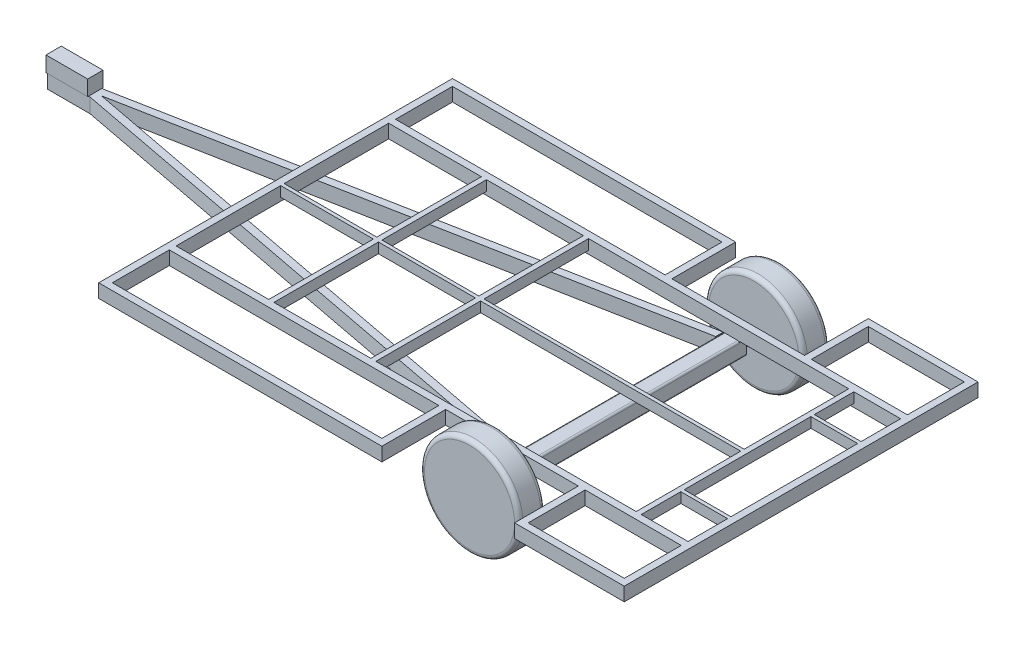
from build123d import *

# Parameters (mm, degrees)
ESQUISSE1_W              = 3090
ESQUISSE1_H              = 2080
ESQUISSE1_W_2            = 3010
ESQUISSE1_H_2            = 2000
BOSS_EXTRU_1_DEPTH       = 80
ESQUISSE2_W              = 3010
ESQUISSE2_H              = 40
ESQUISSE2_W_2            = 40
ESQUISSE2_H_2            = 335
BOSS_EXTRU_7_DEPTH       = 80
BOSS_EXTRU_8_START       = 20
BOSS_EXTRU_8_DEPTH       = 60
ESQUISSE5_W              = 780
ESQUISSE5_H              = 50
ENL_V_MAT_EXTRU_5_DEPTH  = 3726.70798641
ESQUISSE6_W              = 95
ESQUISSE6_H              = 1330
BOSS_EXTRU_9_DEPTH       = 95
CONG_1_R                 = 10
BOSS_EXTRU_10_DEPTH      = 95
BOSS_EXTRU_10_DEPTH_BACK = 1422
ESQUISSE8_R              = 35
ESQUISSE9_R              = 290
BOSS_EXTRU_11_DEPTH      = 155
BOSS_EXTRU_12_START      = 155
ESQUISSE10_R             = 290
BOSS_EXTRU_12_DEPTH      = 155
CONG_2_R                 = 25
BOSS_EXTRU_26_DEPTH      = 85
ESQUISSE12_W             = 245
ESQUISSE12_H             = 90
BOSS_EXTRU_27_DEPTH      = 90


with BuildPart() as part:
    # Esquisse1 → Boss.-Extru.1 (new body)
    with BuildSketch(Plane(origin=(0, 0, 0), x_dir=(1, 0, 0), z_dir=(0, 1, 0))):
        with Locations((1545, 1040)):
            Rectangle(ESQUISSE1_W, ESQUISSE1_H)
        with Locations((1545, 1040)):
            Rectangle(ESQUISSE1_W_2, ESQUISSE1_H_2, mode=Mode.SUBTRACT)
    extrude(amount=BOSS_EXTRU_1_DEPTH)

    # Esquisse2 → Boss.-Extru.7 (add)
    with BuildSketch(Plane(origin=(0, 0, 0), x_dir=(1, 0, 0), z_dir=(0, 1, 0))):
        with Locations((1545, 1685)):
            Rectangle(ESQUISSE2_W, ESQUISSE2_H)
        with Locations((1545, 395)):
            Rectangle(ESQUISSE2_W, ESQUISSE2_H)
        with Locations((1645, 1872.5)):
            Rectangle(ESQUISSE2_W_2, ESQUISSE2_H_2)
        with Locations((2465, 1872.5)):
            Rectangle(ESQUISSE2_W_2, ESQUISSE2_H_2)
        with Locations((1645, 207.5)):
            Rectangle(ESQUISSE2_W_2, ESQUISSE2_H_2)
        with Locations((2465, 207.5)):
            Rectangle(ESQUISSE2_W_2, ESQUISSE2_H_2)
    extrude(amount=BOSS_EXTRU_7_DEPTH)

    # Esquisse4 → Boss.-Extru.8 (add)
    with BuildSketch(Plane(origin=(0, 0, 0), x_dir=(1, 0, 0), z_dir=(0, 1, 0)).offset(BOSS_EXTRU_8_START)):
        Polygon((40, 1050), (585, 1050), (585, 1665), (615, 1665), (615, 1050), (1185, 1050), (1185, 1665), (1215, 1665), (1215, 1050), (2745, 1050), (2745, 1665), (2775, 1665), (2775, 1432.5), (3050, 1432.5), (3050, 1412.5), (2775, 1412.5), (2775, 667.5), (3050, 667.5), (3050, 647.5), (2775, 647.5), (2775, 415), (2745, 415), (2745, 1030), (1215, 1030), (1215, 415), (1185, 415), (1185, 1030), (615, 1030), (615, 415), (585, 415), (585, 1030), (40, 1030), align=None)
    extrude(amount=BOSS_EXTRU_8_DEPTH)

    # Esquisse5 → Enl_v. mat.-Extru.5 (cut, through all)
    with BuildSketch(Plane(origin=(0, 0, 0), x_dir=(1, 0, 0), z_dir=(0, 1, 0))):
        with Locations((2055, 2065)):
            Rectangle(ESQUISSE5_W, ESQUISSE5_H)
        with Locations((2055, 15)):
            Rectangle(ESQUISSE5_W, ESQUISSE5_H)
    extrude(amount=ENL_V_MAT_EXTRU_5_DEPTH, mode=Mode.SUBTRACT)

    # Esquisse6 → Boss.-Extru.9 (add)
    with BuildSketch(Plane(origin=(0, 0, 0), x_dir=(1, 0, 0), z_dir=(0, 1, 0))):
        with Locations((2055, 1040)):
            Rectangle(ESQUISSE6_W, ESQUISSE6_H)
    extrude(amount=-BOSS_EXTRU_9_DEPTH)

    # Cong_1
    cong_1_edges = [part.edges().sort_by_distance(p)[0] for p in [
        (2007.5, 0, -1040),
        (2102.5, 0, -1040),
        (2007.5, -95, -1040),
        (2102.5, -95, -1040),
    ]]
    fillet(cong_1_edges, radius=CONG_1_R)

    # Esquisse8 → Boss.-Extru.10 (add, two sides: drawn at the far end of the back side and taken through both)
    with BuildSketch(Plane.XY.offset(-375).offset(-BOSS_EXTRU_10_DEPTH_BACK)):
        with Locations((2055, -47.5)):
            Circle(ESQUISSE8_R)
    extrude(amount=BOSS_EXTRU_10_DEPTH + BOSS_EXTRU_10_DEPTH_BACK)

    # Esquisse9 → Boss.-Extru.11 (add)
    with BuildSketch(Plane.XY.offset(-280)):
        with Locations((2055, -47.5)):
            Circle(ESQUISSE9_R)
    extrude(amount=BOSS_EXTRU_11_DEPTH)

    # Esquisse10 → Boss.-Extru.12 (add)
    with BuildSketch(Plane(origin=(0, 0, -1797), x_dir=(-1, 0, 0), z_dir=(0, 0, -1)).offset(BOSS_EXTRU_12_START)):
        with Locations(Location((-2055, -47.5, 0), (0, 0, 180))):
            Circle(ESQUISSE10_R)
    extrude(amount=-BOSS_EXTRU_12_DEPTH)

    # Cong_2
    cong_2_edges = [part.edges().sort_by_distance(p)[0] for p in [
        (1765, -47.5, -280),
        (1765, -47.5, -125),
        (1765, -47.5, -1797),
        (1765, -47.5, -1952),
    ]]
    fillet(cong_2_edges, radius=CONG_2_R)


with BuildPart() as body_2:
    # Esquisse11 → Boss.-Extru.26 (new body)
    with BuildSketch(Plane.XZ):
        Polygon((-1300, -1080), (-1050, -1080), (2007.5, -1665), (2007.5, -1620), (-1021.254273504, -1040.5), (-1021.254273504, -1039.5), (2007.5, -460), (2007.5, -415), (-1050, -1000), (-1300, -1000), align=None)
    extrude(amount=BOSS_EXTRU_26_DEPTH)

    # Esquisse12 → Boss.-Extru.27 (add)
    with BuildSketch(Plane(origin=(0, 0, 0), x_dir=(1, 0, 0), z_dir=(0, 1, 0))):
        with Locations((-1182.5, 1040)):
            Rectangle(ESQUISSE12_W, ESQUISSE12_H)
    extrude(amount=BOSS_EXTRU_27_DEPTH)


solid = Compound([part.part, body_2.part])
